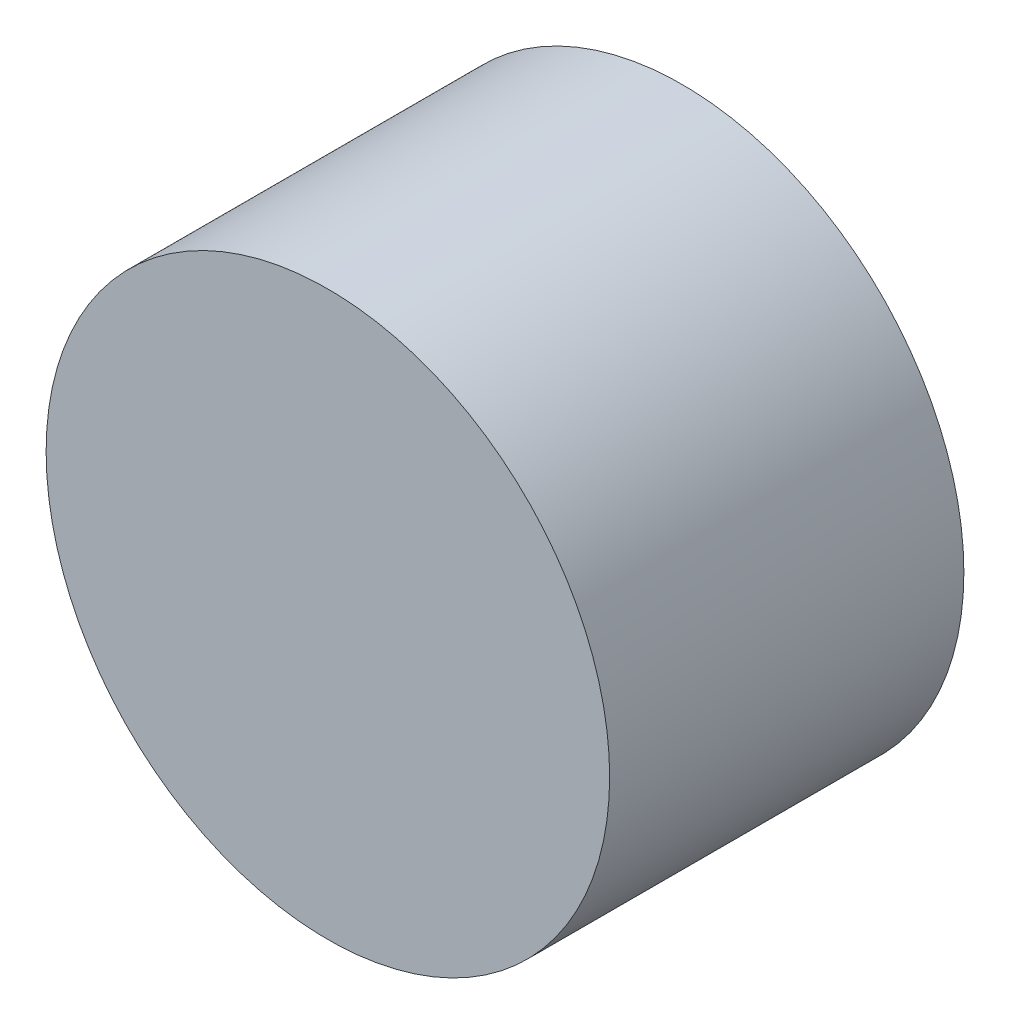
from build123d import *

# Parameters (mm, degrees)
LINEAR_START            = 8
SKIZZE3_R               = 35
LINEAR_AUSTRAGEN1_DEPTH = 8


with BuildPart() as part:
    # Skizze2 → Rotation1 (revolve)
    with BuildSketch(Plane(origin=(0, 0, 0), x_dir=(1, 0, 0), z_dir=(0, 1, 0)), mode=Mode.PRIVATE) as rotation1_sk:
        Polygon((-20, 20), (-20, 23), (-35, 23), (-35, -13), (-19.392272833, -13), (-19.392272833, -5), (-20.5, 0), align=None)
    revolve(rotation1_sk.sketch.rotate(Axis((0, 0, 0), (0, 0, -1)), 180), axis=Axis((0, 0, 0), (0, 0, -1)))

    # Skizze3 → Linear austragen1 (add)
    with BuildSketch(Plane.XY.offset(13).offset(LINEAR_START)):
        Circle(SKIZZE3_R)
    extrude(amount=-LINEAR_AUSTRAGEN1_DEPTH)


solid = part.part
